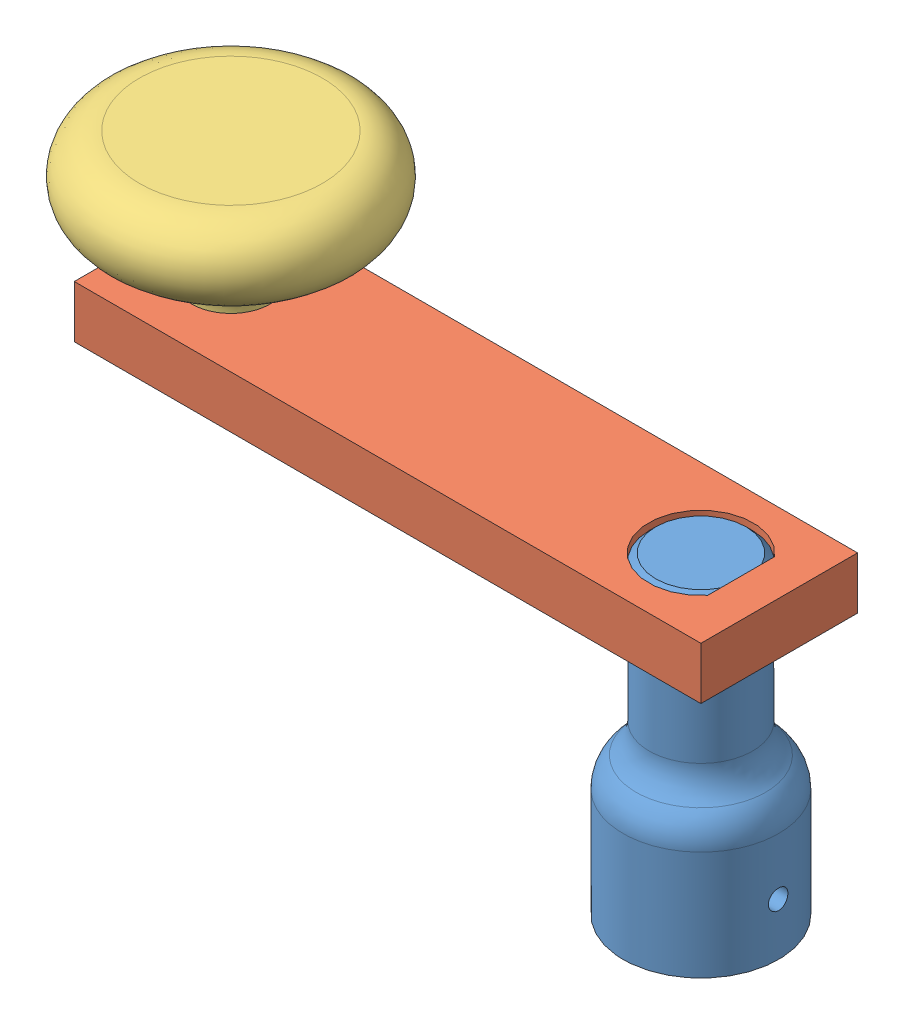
SolidWorks assembly crank sub_&.SLDASM, configuration Default (file format 3100). Lengths in mm.
Overall size (88.68 53.98 44.01).
3 component instances, 3 part files, 5 mates.
Components (placement in the parent):
- crank-shaft_&-1: crank-shaft_&.sldprt [Default] at origin size (18.92 38.1 18.92)
- crank-arm_&-1: crank-arm_&.sldprt [Default] at (-66.675 31.75 -9.525) size (76.2 6.35 19.05)
- crank-knob_&-1: crank-knob_&.sldprt [Default] at (-57.15 31.75 0) x (0.8335 0 0.55252) z (-0.55252 0 0.8335) size (31.75 22.23 31.75)
Mates (geometry in assembly coordinates):
- Concentric1: concentric anti-aligned: cylinder of crank-shaft_&-1; cylinder of crank-arm_&-1
- Parallel1: parallel anti-aligned: plane of crank-shaft_&-1; plane of crank-arm_&-1
- Coincident2: coincident: plane of crank-shaft_&-1; line of crank-arm_&-1
- Concentric2: concentric anti-aligned: cylinder of crank-arm_&-1; cylinder of crank-knob_&-1
- Coincident3: coincident anti-aligned: plane of crank-arm_&-1; plane of crank-knob_&-1
